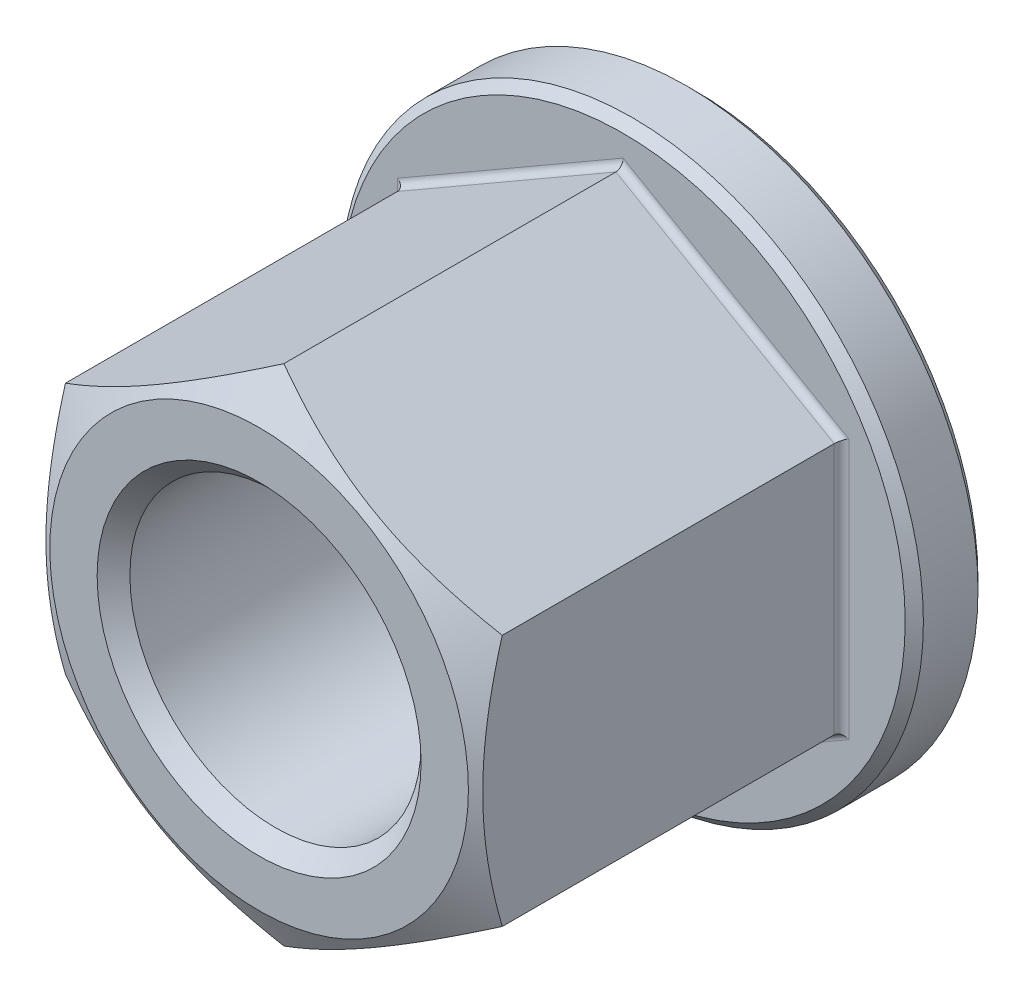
ISO-10303-21;
HEADER;
FILE_DESCRIPTION(('STEP AP214'),'2;1');
FILE_NAME('part.step','',(''),(''),'','','');
FILE_SCHEMA(('AUTOMOTIVE_DESIGN { 1 0 10303 214 1 1 1 1 }'));
ENDSEC;
DATA;
#1=APPLICATION_CONTEXT('core data for automotive mechanical design processes');
#2=APPLICATION_PROTOCOL_DEFINITION('international standard','automotive_design',2000,#1);
#3=PRODUCT_CONTEXT('',#1,'mechanical');
#4=PRODUCT('Part','Part','',(#3));
#5=PRODUCT_RELATED_PRODUCT_CATEGORY('part','',(#4));
#6=PRODUCT_DEFINITION_FORMATION('','',#4);
#7=PRODUCT_DEFINITION_CONTEXT('part definition',#1,'design');
#8=PRODUCT_DEFINITION('design','',#6,#7);
#9=PRODUCT_DEFINITION_SHAPE('','',#8);
#10=(LENGTH_UNIT() NAMED_UNIT(*) SI_UNIT(.MILLI.,.METRE.));
#11=(NAMED_UNIT(*) PLANE_ANGLE_UNIT() SI_UNIT($,.RADIAN.));
#12=(NAMED_UNIT(*) SI_UNIT($,.STERADIAN.) SOLID_ANGLE_UNIT());
#13=UNCERTAINTY_MEASURE_WITH_UNIT(LENGTH_MEASURE(1.E-05),#10,'distance_accuracy_value','');
#14=(GEOMETRIC_REPRESENTATION_CONTEXT(3) GLOBAL_UNCERTAINTY_ASSIGNED_CONTEXT((#13)) GLOBAL_UNIT_ASSIGNED_CONTEXT((#10,
#11,#12)) REPRESENTATION_CONTEXT('',''));
#15=CARTESIAN_POINT('',(0.,0.,0.));
#16=DIRECTION('',(0.,0.,1.));
#17=DIRECTION('',(1.,0.,0.));
#18=AXIS2_PLACEMENT_3D('',#15,#16,#17);
#19=CARTESIAN_POINT('',(-16.,0.,24.));
#20=DIRECTION('',(0.,0.,-1.));
#21=DIRECTION('',(-1.,0.,0.));
#22=AXIS2_PLACEMENT_3D('',#19,#20,#21);
#23=PLANE('',#22);
#24=CARTESIAN_POINT('',(0.,0.,24.));
#25=DIRECTION('',(0.,0.,-1.));
#26=DIRECTION('',(-1.,0.,0.));
#27=AXIS2_PLACEMENT_3D('',#24,#25,#26);
#28=CIRCLE('',#27,8.9);
#29=CARTESIAN_POINT('',(-8.9,0.,24.));
#30=VERTEX_POINT('',#29);
#31=EDGE_CURVE('E247',#30,#30,#28,.T.);
#32=ORIENTED_EDGE('',*,*,#31,.T.);
#33=EDGE_LOOP('',(#32));
#34=FACE_BOUND('',#33,.T.);
#35=CARTESIAN_POINT('',(0.,0.,24.));
#36=DIRECTION('',(0.,0.,1.));
#37=DIRECTION('',(1.,0.,0.));
#38=AXIS2_PLACEMENT_3D('',#35,#36,#37);
#39=CIRCLE('',#38,11.5);
#40=CARTESIAN_POINT('',(11.5,0.,24.));
#41=VERTEX_POINT('',#40);
#42=EDGE_CURVE('E113',#41,#41,#39,.T.);
#43=ORIENTED_EDGE('',*,*,#42,.T.);
#44=EDGE_LOOP('',(#43));
#45=FACE_BOUND('',#44,.T.);
#46=ADVANCED_FACE('F14',(#34,#45),#23,.F.);
#47=CARTESIAN_POINT('',(-12.,-6.92820323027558,4.));
#48=DIRECTION('',(-0.5,-0.86602540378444,0.));
#49=DIRECTION('',(0.86602540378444,-0.5,0.));
#50=AXIS2_PLACEMENT_3D('',#47,#48,#49);
#51=PLANE('',#50);
#52=DIRECTION('',(0.,0.,1.));
#53=VECTOR('',#52,1.);
#54=CARTESIAN_POINT('',(-12.,-6.92820323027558,4.));
#55=LINE('',#54,#53);
#56=CARTESIAN_POINT('',(-12.,-6.92820323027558,4.4));
#57=VERTEX_POINT('',#56);
#58=CARTESIAN_POINT('',(-12.,-6.92820323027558,22.6395280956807));
#59=VERTEX_POINT('',#58);
#60=EDGE_CURVE('E109',#57,#59,#55,.T.);
#61=ORIENTED_EDGE('',*,*,#60,.F.);
#62=DIRECTION('',(0.866025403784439,-0.5,0.));
#63=VECTOR('',#62,1.);
#64=CARTESIAN_POINT('',(0.,-13.8564064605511,4.4));
#65=LINE('',#64,#63);
#66=CARTESIAN_POINT('',(0.,-13.8564064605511,4.4));
#67=VERTEX_POINT('',#66);
#68=EDGE_CURVE('E183',#57,#67,#65,.T.);
#69=ORIENTED_EDGE('',*,*,#68,.T.);
#70=DIRECTION('',(0.,0.,1.));
#71=VECTOR('',#70,1.);
#72=CARTESIAN_POINT('',(0.,-13.8564064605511,4.));
#73=LINE('',#72,#71);
#74=CARTESIAN_POINT('',(0.,-13.8564064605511,22.6395280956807));
#75=VERTEX_POINT('',#74);
#76=EDGE_CURVE('E95',#67,#75,#73,.T.);
#77=ORIENTED_EDGE('',*,*,#76,.T.);
#78=CARTESIAN_POINT('',(0.000199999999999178,-13.8565219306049,22.6394614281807));
#79=CARTESIAN_POINT('',(-0.263585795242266,-13.7042251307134,22.7273752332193));
#80=CARTESIAN_POINT('',(-0.528355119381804,-13.5513604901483,22.8112988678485));
#81=CARTESIAN_POINT('',(-1.06001701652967,-13.2444053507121,22.9700586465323));
#82=CARTESIAN_POINT('',(-1.32691025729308,-13.0903144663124,23.0448918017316));
#83=CARTESIAN_POINT('',(-2.13189040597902,-12.6255589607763,23.254307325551));
#84=CARTESIAN_POINT('',(-2.67315507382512,-12.3130596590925,23.3734216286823));
#85=CARTESIAN_POINT('',(-3.48313282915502,-11.8454187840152,23.513093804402));
#86=CARTESIAN_POINT('',(-3.74942610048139,-11.6916742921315,23.5528810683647));
#87=CARTESIAN_POINT('',(-4.28324559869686,-11.3834734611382,23.6196014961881));
#88=CARTESIAN_POINT('',(-4.5507718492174,-11.2290171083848,23.6465344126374));
#89=CARTESIAN_POINT('',(-5.08627036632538,-10.9198468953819,23.6868562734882));
#90=CARTESIAN_POINT('',(-5.35424172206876,-10.7651335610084,23.7002613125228));
#91=CARTESIAN_POINT('',(-5.89043273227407,-10.4555635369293,23.713241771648));
#92=CARTESIAN_POINT('',(-6.15865237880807,-10.3007068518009,23.7128176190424));
#93=CARTESIAN_POINT('',(-6.66008937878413,-10.0112020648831,23.6991048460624));
#94=CARTESIAN_POINT('',(-6.89334249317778,-9.87653331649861,23.6874888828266));
#95=CARTESIAN_POINT('',(-7.35931224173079,-9.6075055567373,23.6540168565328));
#96=CARTESIAN_POINT('',(-7.59202883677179,-9.47314656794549,23.6321600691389));
#97=CARTESIAN_POINT('',(-8.05679907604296,-9.20481134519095,23.5785874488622));
#98=CARTESIAN_POINT('',(-8.28885201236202,-9.0708355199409,23.5468634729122));
#99=CARTESIAN_POINT('',(-8.751869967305,-8.80351197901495,23.4741130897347));
#100=CARTESIAN_POINT('',(-8.98283491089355,-8.67016430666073,23.433086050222));
#101=CARTESIAN_POINT('',(-9.68394195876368,-8.26537996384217,23.2950132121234));
#102=CARTESIAN_POINT('',(-10.1520537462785,-7.99511549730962,23.1841999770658));
#103=CARTESIAN_POINT('',(-11.0812971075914,-7.45861659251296,22.9326990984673));
#104=CARTESIAN_POINT('',(-11.5424405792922,-7.1923752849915,22.7920705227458));
#105=CARTESIAN_POINT('',(-12.0002,-6.92808776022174,22.6394614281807));
#106=B_SPLINE_CURVE_WITH_KNOTS('',3,(#78,#79,#80,#81,#82,#83,#84,#85,#86,#87,#88,#89,#90,#91,
#92,#93,#94,#95,#96,#97,#98,#99,#100,#101,#102,#103,#104,#105),.UNSPECIFIED.,.F.,.F.,(4,2,2,2,2,
2,2,2,2,2,2,2,2,4),(0.,0.951004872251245,1.90232158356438,3.8090046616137,4.73894551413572,
5.66890426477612,6.59775529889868,7.52657763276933,8.3351464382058,9.1437724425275,
9.95306755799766,10.7624176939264,12.4167102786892,14.0677556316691),.UNSPECIFIED.);
#107=EDGE_CURVE('E107',#75,#59,#106,.T.);
#108=ORIENTED_EDGE('',*,*,#107,.T.);
#109=EDGE_LOOP('',(#61,#69,#77,#108));
#110=FACE_BOUND('',#109,.T.);
#111=ADVANCED_FACE('F168',(#110),#51,.T.);
#112=CARTESIAN_POINT('',(-12.,6.92820323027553,4.));
#113=DIRECTION('',(-1.,0.,0.));
#114=DIRECTION('',(0.,-1.,0.));
#115=AXIS2_PLACEMENT_3D('',#112,#113,#114);
#116=PLANE('',#115);
#117=DIRECTION('',(0.,0.,1.));
#118=VECTOR('',#117,1.);
#119=CARTESIAN_POINT('',(-12.,6.92820323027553,4.));
#120=LINE('',#119,#118);
#121=CARTESIAN_POINT('',(-12.,6.92820323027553,4.4));
#122=VERTEX_POINT('',#121);
#123=CARTESIAN_POINT('',(-12.,6.92820323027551,22.6395280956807));
#124=VERTEX_POINT('',#123);
#125=EDGE_CURVE('E184',#122,#124,#120,.T.);
#126=ORIENTED_EDGE('',*,*,#125,.F.);
#127=DIRECTION('',(0.,-1.,0.));
#128=VECTOR('',#127,1.);
#129=CARTESIAN_POINT('',(-12.,-6.92820323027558,4.4));
#130=LINE('',#129,#128);
#131=EDGE_CURVE('E193',#122,#57,#130,.T.);
#132=ORIENTED_EDGE('',*,*,#131,.T.);
#133=ORIENTED_EDGE('',*,*,#60,.T.);
#134=CARTESIAN_POINT('',(-12.,-18.5173220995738,17.8999412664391));
#135=CARTESIAN_POINT('',(-12.,-18.2556548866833,18.026718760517));
#136=CARTESIAN_POINT('',(-12.,-17.9936780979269,18.1528569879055));
#137=CARTESIAN_POINT('',(-12.,-17.4690407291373,18.4037099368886));
#138=CARTESIAN_POINT('',(-12.,-17.2063801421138,18.52842464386));
#139=CARTESIAN_POINT('',(-12.,-16.4172044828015,18.900249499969));
#140=CARTESIAN_POINT('',(-12.,-15.8895743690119,19.1450020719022));
#141=CARTESIAN_POINT('',(-12.,-14.8278359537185,19.6280601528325));
#142=CARTESIAN_POINT('',(-12.,-14.2937079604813,19.86632248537));
#143=CARTESIAN_POINT('',(-12.,-13.2211715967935,20.3329756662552));
#144=CARTESIAN_POINT('',(-12.,-12.6827634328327,20.561366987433));
#145=CARTESIAN_POINT('',(-12.,-11.5838024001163,21.0126469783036));
#146=CARTESIAN_POINT('',(-12.,-11.0230851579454,21.2351374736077));
#147=CARTESIAN_POINT('',(-12.,-9.89505250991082,21.6630547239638));
#148=CARTESIAN_POINT('',(-12.,-9.32773636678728,21.8684795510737));
#149=CARTESIAN_POINT('',(-12.,-8.18671425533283,22.2568017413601));
#150=CARTESIAN_POINT('',(-12.,-7.61302421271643,22.4397455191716));
#151=CARTESIAN_POINT('',(-12.,-6.45736105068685,22.7771839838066));
#152=CARTESIAN_POINT('',(-12.,-5.87539063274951,22.931687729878));
#153=CARTESIAN_POINT('',(-12.,-4.99773238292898,23.1360569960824));
#154=CARTESIAN_POINT('',(-12.,-4.70518231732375,23.1994826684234));
#155=CARTESIAN_POINT('',(-12.,-4.1181008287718,23.3164400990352));
#156=CARTESIAN_POINT('',(-12.,-3.82356944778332,23.3699720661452));
#157=CARTESIAN_POINT('',(-12.,-3.23273474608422,23.4661916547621));
#158=CARTESIAN_POINT('',(-12.,-2.93643144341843,23.5088793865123));
#159=CARTESIAN_POINT('',(-12.,-2.34237499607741,23.5825554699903));
#160=CARTESIAN_POINT('',(-12.,-2.04462190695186,23.613544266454));
#161=CARTESIAN_POINT('',(-12.,-1.45192885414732,23.6628234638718));
#162=CARTESIAN_POINT('',(-12.,-1.15700216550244,23.6812725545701));
#163=CARTESIAN_POINT('',(-12.,-0.566633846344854,23.7056885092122));
#164=CARTESIAN_POINT('',(-12.,-0.271192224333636,23.7116555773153));
#165=CARTESIAN_POINT('',(-12.,0.319680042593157,23.7109658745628));
#166=CARTESIAN_POINT('',(-12.,0.615110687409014,23.7043090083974));
#167=CARTESIAN_POINT('',(-12.,1.20543136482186,23.6785321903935));
#168=CARTESIAN_POINT('',(-12.,1.50032137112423,23.6594116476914));
#169=CARTESIAN_POINT('',(-12.,2.21185884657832,23.5986407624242));
#170=CARTESIAN_POINT('',(-12.,2.6279967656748,23.5509201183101));
#171=CARTESIAN_POINT('',(-12.,3.4571252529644,23.4332802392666));
#172=CARTESIAN_POINT('',(-12.,3.87011537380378,23.3633579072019));
#173=CARTESIAN_POINT('',(-12.,4.69257458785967,23.2038022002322));
#174=CARTESIAN_POINT('',(-12.,5.10204061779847,23.1141531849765));
#175=CARTESIAN_POINT('',(-12.,5.91683664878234,22.9178742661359));
#176=CARTESIAN_POINT('',(-12.,6.32216671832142,22.8112446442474));
#177=CARTESIAN_POINT('',(-12.,7.1375608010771,22.5810853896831));
#178=CARTESIAN_POINT('',(-12.,7.54753418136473,22.4572368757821));
#179=CARTESIAN_POINT('',(-12.,8.36344122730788,22.196947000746));
#180=CARTESIAN_POINT('',(-12.,8.76937486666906,22.0605055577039));
#181=CARTESIAN_POINT('',(-12.,9.5774067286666,21.7771784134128));
#182=CARTESIAN_POINT('',(-12.,9.97950622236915,21.6302963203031));
#183=CARTESIAN_POINT('',(-12.,10.7803867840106,21.3277959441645));
#184=CARTESIAN_POINT('',(-12.,11.1791678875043,21.1721777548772));
#185=CARTESIAN_POINT('',(-12.,12.1066298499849,20.8004102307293));
#186=CARTESIAN_POINT('',(-12.,12.6341689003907,20.5814169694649));
#187=CARTESIAN_POINT('',(-12.,13.6848815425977,20.1331681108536));
#188=CARTESIAN_POINT('',(-12.,14.208054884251,19.9039119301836));
#189=CARTESIAN_POINT('',(-12.,15.2508319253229,19.4371558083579));
#190=CARTESIAN_POINT('',(-12.,15.7704348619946,19.199654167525));
#191=CARTESIAN_POINT('',(-12.,16.8065478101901,18.7180393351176));
#192=CARTESIAN_POINT('',(-12.,17.3230578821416,18.4739262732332));
#193=CARTESIAN_POINT('',(-12.,18.3540223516,17.9800481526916));
#194=CARTESIAN_POINT('',(-12.,18.868474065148,17.7302775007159));
#195=CARTESIAN_POINT('',(-12.,19.89519003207,17.2262809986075));
#196=CARTESIAN_POINT('',(-12.,20.4074542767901,16.9720551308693));
#197=CARTESIAN_POINT('',(-12.,21.4300648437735,16.4599305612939));
#198=CARTESIAN_POINT('',(-12.,21.9404113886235,16.2020323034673));
#199=CARTESIAN_POINT('',(-12.,22.9595211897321,15.6831246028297));
#200=CARTESIAN_POINT('',(-12.,23.4682844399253,15.4221151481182));
#201=CARTESIAN_POINT('',(-12.,24.909614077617,14.6779720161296));
#202=CARTESIAN_POINT('',(-12.,25.8405746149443,14.1917279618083));
#203=CARTESIAN_POINT('',(-12.,27.6990334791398,13.2126098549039));
#204=CARTESIAN_POINT('',(-12.,28.6265316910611,12.7197355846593));
#205=CARTESIAN_POINT('',(-12.,30.4766080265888,11.7300698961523));
#206=CARTESIAN_POINT('',(-12.,31.3991926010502,11.2332905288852));
#207=CARTESIAN_POINT('',(-12.,32.7814296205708,10.4851527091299));
#208=CARTESIAN_POINT('',(-12.,33.2418901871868,10.2352850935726));
#209=CARTESIAN_POINT('',(-12.,34.1623256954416,9.7346586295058));
#210=CARTESIAN_POINT('',(-12.,34.6223006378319,9.48389978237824));
#211=CARTESIAN_POINT('',(-12.,35.082060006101,9.2327461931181));
#212=B_SPLINE_CURVE_WITH_KNOTS('',3,(#134,#135,#136,#137,#138,#139,#140,#141,#142,#143,#144,
#145,#146,#147,#148,#149,#150,#151,#152,#153,#154,#155,#156,#157,#158,#159,#160,#161,#162,#163,
#164,#165,#166,#167,#168,#169,#170,#171,#172,#173,#174,#175,#176,#177,#178,#179,#180,#181,#182,
#183,#184,#185,#186,#187,#188,#189,#190,#191,#192,#193,#194,#195,#196,#197,#198,#199,#200,#201,
#202,#203,#204,#205,#206,#207,#208,#209,#210,#211),.UNSPECIFIED.,.F.,.F.,(4,2,2,2,2,2,2,2,2,2,2,
2,2,2,2,2,2,2,2,2,2,2,2,2,2,2,2,2,2,2,2,2,2,2,2,2,2,2,4),(0.,0.872282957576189,1.74457486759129,
3.48942168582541,5.24392502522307,6.99834422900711,8.80787044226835,10.6176008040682,
12.4235296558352,14.2288822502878,15.1267816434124,16.0246620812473,16.9225333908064,
17.8203705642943,18.7066228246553,19.5928605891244,20.4791050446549,21.3653915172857,
22.6212900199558,23.8773637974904,25.1344370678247,26.3914894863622,27.6760622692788,
28.9606434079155,30.2447827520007,31.5289083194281,33.2423257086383,34.955840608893,
36.6697108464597,38.3835474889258,40.0991596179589,41.8147785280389,43.5301917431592,
45.2456115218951,48.3964579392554,51.5474080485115,54.6908909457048,56.262551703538,
57.8342100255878),.UNSPECIFIED.);
#213=EDGE_CURVE('E156',#59,#124,#212,.T.);
#214=ORIENTED_EDGE('',*,*,#213,.T.);
#215=EDGE_LOOP('',(#126,#132,#133,#214));
#216=FACE_BOUND('',#215,.T.);
#217=ADVANCED_FACE('F146',(#216),#116,.T.);
#218=CARTESIAN_POINT('',(0.,13.856406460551,4.));
#219=DIRECTION('',(-0.5,0.86602540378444,0.));
#220=DIRECTION('',(-0.86602540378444,-0.5,0.));
#221=AXIS2_PLACEMENT_3D('',#218,#219,#220);
#222=PLANE('',#221);
#223=DIRECTION('',(0.,0.,1.));
#224=VECTOR('',#223,1.);
#225=CARTESIAN_POINT('',(0.,13.856406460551,4.));
#226=LINE('',#225,#224);
#227=CARTESIAN_POINT('',(0.,13.856406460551,4.4));
#228=VERTEX_POINT('',#227);
#229=CARTESIAN_POINT('',(0.,13.856406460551,22.6395280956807));
#230=VERTEX_POINT('',#229);
#231=EDGE_CURVE('E294',#228,#230,#226,.T.);
#232=ORIENTED_EDGE('',*,*,#231,.F.);
#233=DIRECTION('',(-0.866025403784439,-0.5,0.));
#234=VECTOR('',#233,1.);
#235=CARTESIAN_POINT('',(-12.,6.92820323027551,4.4));
#236=LINE('',#235,#234);
#237=EDGE_CURVE('E205',#228,#122,#236,.T.);
#238=ORIENTED_EDGE('',*,*,#237,.T.);
#239=ORIENTED_EDGE('',*,*,#125,.T.);
#240=CARTESIAN_POINT('',(-12.0002,6.92808776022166,22.6394614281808));
#241=CARTESIAN_POINT('',(-11.7364142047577,7.08038456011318,22.7273752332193));
#242=CARTESIAN_POINT('',(-11.4716448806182,7.2332492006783,22.8112988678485));
#243=CARTESIAN_POINT('',(-10.9399829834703,7.54020434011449,22.9700586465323));
#244=CARTESIAN_POINT('',(-10.6730897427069,7.69429522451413,23.0448918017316));
#245=CARTESIAN_POINT('',(-9.86810959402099,8.15905073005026,23.254307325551));
#246=CARTESIAN_POINT('',(-9.3268449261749,8.47155003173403,23.3734216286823));
#247=CARTESIAN_POINT('',(-8.51686717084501,8.93919090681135,23.513093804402));
#248=CARTESIAN_POINT('',(-8.25057389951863,9.09293539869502,23.5528810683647));
#249=CARTESIAN_POINT('',(-7.71675440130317,9.40113622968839,23.6196014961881));
#250=CARTESIAN_POINT('',(-7.44922815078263,9.55559258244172,23.6465344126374));
#251=CARTESIAN_POINT('',(-6.91372963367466,9.86476279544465,23.6868562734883));
#252=CARTESIAN_POINT('',(-6.64575827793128,10.0194761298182,23.7002613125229));
#253=CARTESIAN_POINT('',(-6.10956726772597,10.3290461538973,23.713241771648));
#254=CARTESIAN_POINT('',(-5.84134762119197,10.4839028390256,23.7128176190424));
#255=CARTESIAN_POINT('',(-5.3399106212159,10.7734076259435,23.6991048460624));
#256=CARTESIAN_POINT('',(-5.10665750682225,10.908076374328,23.6874888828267));
#257=CARTESIAN_POINT('',(-4.64068775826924,11.1771041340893,23.6540168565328));
#258=CARTESIAN_POINT('',(-4.40797116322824,11.3114631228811,23.632160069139));
#259=CARTESIAN_POINT('',(-3.94320092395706,11.5797983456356,23.5785874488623));
#260=CARTESIAN_POINT('',(-3.711147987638,11.7137741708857,23.5468634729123));
#261=CARTESIAN_POINT('',(-3.24813003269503,11.9810977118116,23.4741130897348));
#262=CARTESIAN_POINT('',(-3.01716508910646,12.1144453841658,23.433086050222));
#263=CARTESIAN_POINT('',(-2.31605804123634,12.5192297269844,23.2950132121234));
#264=CARTESIAN_POINT('',(-1.84794625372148,12.7894941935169,23.1841999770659));
#265=CARTESIAN_POINT('',(-0.918702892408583,13.3259930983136,22.9326990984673));
#266=CARTESIAN_POINT('',(-0.45755942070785,13.5922344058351,22.7920705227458));
#267=CARTESIAN_POINT('',(0.000199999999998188,13.8565219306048,22.6394614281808));
#268=B_SPLINE_CURVE_WITH_KNOTS('',3,(#240,#241,#242,#243,#244,#245,#246,#247,#248,#249,#250,
#251,#252,#253,#254,#255,#256,#257,#258,#259,#260,#261,#262,#263,#264,#265,#266,#267),
.UNSPECIFIED.,.F.,.F.,(4,2,2,2,2,2,2,2,2,2,2,2,2,4),(0.,0.95100487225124,1.90232158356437,
3.80900466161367,4.73894551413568,5.66890426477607,6.59775529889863,7.52657763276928,
8.33514643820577,9.14377244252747,9.95306755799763,10.7624176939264,12.4167102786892,
14.0677556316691),.UNSPECIFIED.);
#269=EDGE_CURVE('E115',#124,#230,#268,.T.);
#270=ORIENTED_EDGE('',*,*,#269,.T.);
#271=EDGE_LOOP('',(#232,#238,#239,#270));
#272=FACE_BOUND('',#271,.T.);
#273=ADVANCED_FACE('F142',(#272),#222,.T.);
#274=CARTESIAN_POINT('',(12.,6.92820323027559,4.));
#275=DIRECTION('',(0.499999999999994,0.866025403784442,0.));
#276=DIRECTION('',(-0.866025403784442,0.499999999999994,0.));
#277=AXIS2_PLACEMENT_3D('',#274,#275,#276);
#278=PLANE('',#277);
#279=DIRECTION('',(0.,0.,1.));
#280=VECTOR('',#279,1.);
#281=CARTESIAN_POINT('',(12.,6.92820323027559,4.));
#282=LINE('',#281,#280);
#283=CARTESIAN_POINT('',(12.,6.92820323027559,4.4));
#284=VERTEX_POINT('',#283);
#285=CARTESIAN_POINT('',(12.,6.92820323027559,22.6395280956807));
#286=VERTEX_POINT('',#285);
#287=EDGE_CURVE('E94',#284,#286,#282,.T.);
#288=ORIENTED_EDGE('',*,*,#287,.F.);
#289=DIRECTION('',(-0.866025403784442,0.499999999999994,0.));
#290=VECTOR('',#289,1.);
#291=CARTESIAN_POINT('',(0.,13.856406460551,4.4));
#292=LINE('',#291,#290);
#293=EDGE_CURVE('E36',#284,#228,#292,.T.);
#294=ORIENTED_EDGE('',*,*,#293,.T.);
#295=ORIENTED_EDGE('',*,*,#231,.T.);
#296=CARTESIAN_POINT('',(-0.000200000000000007,13.8565219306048,22.6394614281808));
#297=CARTESIAN_POINT('',(0.263585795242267,13.7042251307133,22.7273752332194));
#298=CARTESIAN_POINT('',(0.528355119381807,13.5513604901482,22.8112988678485));
#299=CARTESIAN_POINT('',(1.06001701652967,13.244405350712,22.9700586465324));
#300=CARTESIAN_POINT('',(1.32691025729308,13.0903144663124,23.0448918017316));
#301=CARTESIAN_POINT('',(2.13189040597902,12.6255589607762,23.254307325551));
#302=CARTESIAN_POINT('',(2.67315507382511,12.3130596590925,23.3734216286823));
#303=CARTESIAN_POINT('',(3.48313282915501,11.8454187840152,23.513093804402));
#304=CARTESIAN_POINT('',(3.74942610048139,11.6916742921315,23.5528810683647));
#305=CARTESIAN_POINT('',(4.28324559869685,11.3834734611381,23.6196014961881));
#306=CARTESIAN_POINT('',(4.55077184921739,11.2290171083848,23.6465344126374));
#307=CARTESIAN_POINT('',(5.08627036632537,10.9198468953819,23.6868562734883));
#308=CARTESIAN_POINT('',(5.35424172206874,10.7651335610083,23.7002613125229));
#309=CARTESIAN_POINT('',(5.89043273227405,10.4555635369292,23.713241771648));
#310=CARTESIAN_POINT('',(6.15865237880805,10.3007068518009,23.7128176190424));
#311=CARTESIAN_POINT('',(6.66008937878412,10.0112020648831,23.6991048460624));
#312=CARTESIAN_POINT('',(6.89334249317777,9.87653331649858,23.6874888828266));
#313=CARTESIAN_POINT('',(7.35931224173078,9.60750555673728,23.6540168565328));
#314=CARTESIAN_POINT('',(7.59202883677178,9.47314656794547,23.6321600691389));
#315=CARTESIAN_POINT('',(8.05679907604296,9.20481134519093,23.5785874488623));
#316=CARTESIAN_POINT('',(8.28885201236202,9.07083551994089,23.5468634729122));
#317=CARTESIAN_POINT('',(8.75186996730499,8.80351197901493,23.4741130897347));
#318=CARTESIAN_POINT('',(8.98283491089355,8.67016430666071,23.433086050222));
#319=CARTESIAN_POINT('',(9.68394195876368,8.26537996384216,23.2950132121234));
#320=CARTESIAN_POINT('',(10.1520537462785,7.99511549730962,23.1841999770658));
#321=CARTESIAN_POINT('',(11.0812971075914,7.45861659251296,22.9326990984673));
#322=CARTESIAN_POINT('',(11.5424405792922,7.19237528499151,22.7920705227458));
#323=CARTESIAN_POINT('',(12.0002,6.92808776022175,22.6394614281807));
#324=B_SPLINE_CURVE_WITH_KNOTS('',3,(#296,#297,#298,#299,#300,#301,#302,#303,#304,#305,#306,
#307,#308,#309,#310,#311,#312,#313,#314,#315,#316,#317,#318,#319,#320,#321,#322,#323),
.UNSPECIFIED.,.F.,.F.,(4,2,2,2,2,2,2,2,2,2,2,2,2,4),(0.,0.951004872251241,1.90232158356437,
3.80900466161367,4.73894551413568,5.66890426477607,6.59775529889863,7.52657763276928,
8.33514643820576,9.14377244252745,9.95306755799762,10.7624176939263,12.4167102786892,
14.0677556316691),.UNSPECIFIED.);
#325=EDGE_CURVE('E112',#230,#286,#324,.T.);
#326=ORIENTED_EDGE('',*,*,#325,.T.);
#327=EDGE_LOOP('',(#288,#294,#295,#326));
#328=FACE_BOUND('',#327,.T.);
#329=ADVANCED_FACE('F137',(#328),#278,.T.);
#330=CARTESIAN_POINT('',(12.,-6.92820323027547,4.));
#331=DIRECTION('',(1.,0.,0.));
#332=DIRECTION('',(0.,1.,0.));
#333=AXIS2_PLACEMENT_3D('',#330,#331,#332);
#334=PLANE('',#333);
#335=DIRECTION('',(0.,0.,1.));
#336=VECTOR('',#335,1.);
#337=CARTESIAN_POINT('',(12.,-6.92820323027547,4.));
#338=LINE('',#337,#336);
#339=CARTESIAN_POINT('',(12.,-6.92820323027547,4.4));
#340=VERTEX_POINT('',#339);
#341=CARTESIAN_POINT('',(12.,-6.92820323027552,22.6395280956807));
#342=VERTEX_POINT('',#341);
#343=EDGE_CURVE('E86',#340,#342,#338,.T.);
#344=ORIENTED_EDGE('',*,*,#343,.F.);
#345=DIRECTION('',(0.,1.,0.));
#346=VECTOR('',#345,1.);
#347=CARTESIAN_POINT('',(12.,6.92820323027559,4.4));
#348=LINE('',#347,#346);
#349=EDGE_CURVE('E29',#340,#284,#348,.T.);
#350=ORIENTED_EDGE('',*,*,#349,.T.);
#351=ORIENTED_EDGE('',*,*,#287,.T.);
#352=CARTESIAN_POINT('',(12.,-18.51732209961,17.8999412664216));
#353=CARTESIAN_POINT('',(12.,-18.2556548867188,18.0267187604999));
#354=CARTESIAN_POINT('',(12.,-17.9936780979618,18.1528569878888));
#355=CARTESIAN_POINT('',(12.,-17.469040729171,18.4037099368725));
#356=CARTESIAN_POINT('',(12.,-17.2063801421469,18.5284246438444));
#357=CARTESIAN_POINT('',(12.,-16.4172044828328,18.9002494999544));
#358=CARTESIAN_POINT('',(12.,-15.889574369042,19.1450020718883));
#359=CARTESIAN_POINT('',(12.,-14.8278359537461,19.6280601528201));
#360=CARTESIAN_POINT('',(12.,-14.2937079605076,19.8663224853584));
#361=CARTESIAN_POINT('',(12.,-13.2211715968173,20.332975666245));
#362=CARTESIAN_POINT('',(12.,-12.6827634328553,20.5613669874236));
#363=CARTESIAN_POINT('',(12.,-11.5838024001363,21.0126469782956));
#364=CARTESIAN_POINT('',(12.,-11.023085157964,21.2351374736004));
#365=CARTESIAN_POINT('',(12.,-9.89505250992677,21.6630547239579));
#366=CARTESIAN_POINT('',(12.,-9.32773636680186,21.8684795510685));
#367=CARTESIAN_POINT('',(12.,-8.18671425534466,22.2568017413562));
#368=CARTESIAN_POINT('',(12.,-7.61302421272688,22.4397455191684));
#369=CARTESIAN_POINT('',(12.,-6.45736105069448,22.7771839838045));
#370=CARTESIAN_POINT('',(12.,-5.87539063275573,22.9316877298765));
#371=CARTESIAN_POINT('',(12.,-4.99773238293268,23.1360569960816));
#372=CARTESIAN_POINT('',(12.,-4.70518231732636,23.1994826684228));
#373=CARTESIAN_POINT('',(12.,-4.11810082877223,23.3164400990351));
#374=CARTESIAN_POINT('',(12.,-3.82356944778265,23.3699720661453));
#375=CARTESIAN_POINT('',(12.,-3.23273474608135,23.4661916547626));
#376=CARTESIAN_POINT('',(12.,-2.93643144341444,23.5088793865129));
#377=CARTESIAN_POINT('',(12.,-2.34237499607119,23.582555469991));
#378=CARTESIAN_POINT('',(12.,-2.04462190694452,23.6135442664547));
#379=CARTESIAN_POINT('',(12.,-1.45192885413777,23.6628234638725));
#380=CARTESIAN_POINT('',(12.,-1.1570021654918,23.6812725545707));
#381=CARTESIAN_POINT('',(12.,-0.56663384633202,23.7056885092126));
#382=CARTESIAN_POINT('',(12.,-0.271192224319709,23.7116555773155));
#383=CARTESIAN_POINT('',(12.,0.319680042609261,23.7109658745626));
#384=CARTESIAN_POINT('',(12.,0.615110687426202,23.704309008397));
#385=CARTESIAN_POINT('',(12.,1.20543136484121,23.6785321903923));
#386=CARTESIAN_POINT('',(12.,1.50032137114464,23.6594116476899));
#387=CARTESIAN_POINT('',(12.,2.21185884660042,23.5986407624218));
#388=CARTESIAN_POINT('',(12.,2.62799676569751,23.5509201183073));
#389=CARTESIAN_POINT('',(12.,3.45712525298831,23.4332802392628));
#390=CARTESIAN_POINT('',(12.,3.87011537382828,23.3633579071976));
#391=CARTESIAN_POINT('',(12.,4.69257458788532,23.2038022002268));
#392=CARTESIAN_POINT('',(12.,5.10204061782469,23.1141531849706));
#393=CARTESIAN_POINT('',(12.,5.91683664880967,22.9178742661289));
#394=CARTESIAN_POINT('',(12.,6.3221667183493,22.8112446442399));
#395=CARTESIAN_POINT('',(12.,7.1375608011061,22.5810853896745));
#396=CARTESIAN_POINT('',(12.,7.54753418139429,22.457236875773));
#397=CARTESIAN_POINT('',(12.,8.36344122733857,22.1969470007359));
#398=CARTESIAN_POINT('',(12.,8.76937486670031,22.0605055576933));
#399=CARTESIAN_POINT('',(12.,9.57740672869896,21.7771784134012));
#400=CARTESIAN_POINT('',(12.,9.97950622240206,21.6302963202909));
#401=CARTESIAN_POINT('',(12.,10.7803867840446,21.3277959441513));
#402=CARTESIAN_POINT('',(12.,11.1791678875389,21.1721777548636));
#403=CARTESIAN_POINT('',(12.,12.1066298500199,20.800410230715));
#404=CARTESIAN_POINT('',(12.,12.6341689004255,20.5814169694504));
#405=CARTESIAN_POINT('',(12.,13.6848815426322,20.1331681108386));
#406=CARTESIAN_POINT('',(12.,14.2080548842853,19.9039119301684));
#407=CARTESIAN_POINT('',(12.,15.250831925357,19.4371558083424));
#408=CARTESIAN_POINT('',(12.,15.7704348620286,19.1996541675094));
#409=CARTESIAN_POINT('',(12.,16.8065478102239,18.7180393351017));
#410=CARTESIAN_POINT('',(12.,17.3230578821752,18.4739262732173));
#411=CARTESIAN_POINT('',(12.,18.3540223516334,17.9800481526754));
#412=CARTESIAN_POINT('',(12.,18.8684740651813,17.7302775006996));
#413=CARTESIAN_POINT('',(12.,19.8951900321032,17.2262809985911));
#414=CARTESIAN_POINT('',(12.,20.4074542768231,16.9720551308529));
#415=CARTESIAN_POINT('',(12.,21.4300648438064,16.4599305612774));
#416=CARTESIAN_POINT('',(12.,21.9404113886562,16.2020323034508));
#417=CARTESIAN_POINT('',(12.,22.9595211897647,15.683124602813));
#418=CARTESIAN_POINT('',(12.,23.4682844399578,15.4221151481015));
#419=CARTESIAN_POINT('',(12.,24.9096140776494,14.6779720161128));
#420=CARTESIAN_POINT('',(12.,25.8405746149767,14.1917279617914));
#421=CARTESIAN_POINT('',(12.,27.6990334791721,13.2126098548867));
#422=CARTESIAN_POINT('',(12.,28.6265316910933,12.7197355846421));
#423=CARTESIAN_POINT('',(12.,30.4766080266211,11.730069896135));
#424=CARTESIAN_POINT('',(12.,31.3991926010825,11.2332905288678));
#425=CARTESIAN_POINT('',(12.,32.7814296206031,10.4851527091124));
#426=CARTESIAN_POINT('',(12.,33.2418901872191,10.235285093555));
#427=CARTESIAN_POINT('',(12.,34.1623256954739,9.73465862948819));
#428=CARTESIAN_POINT('',(12.,34.6223006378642,9.4838997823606));
#429=CARTESIAN_POINT('',(12.,35.0820600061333,9.23274619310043));
#430=B_SPLINE_CURVE_WITH_KNOTS('',3,(#352,#353,#354,#355,#356,#357,#358,#359,#360,#361,#362,
#363,#364,#365,#366,#367,#368,#369,#370,#371,#372,#373,#374,#375,#376,#377,#378,#379,#380,#381,
#382,#383,#384,#385,#386,#387,#388,#389,#390,#391,#392,#393,#394,#395,#396,#397,#398,#399,#400,
#401,#402,#403,#404,#405,#406,#407,#408,#409,#410,#411,#412,#413,#414,#415,#416,#417,#418,#419,
#420,#421,#422,#423,#424,#425,#426,#427,#428,#429),.UNSPECIFIED.,.F.,.F.,(4,2,2,2,2,2,2,2,2,2,2,
2,2,2,2,2,2,2,2,2,2,2,2,2,2,2,2,2,2,2,2,2,2,2,2,2,2,2,4),(0.,0.872282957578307,1.74457486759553,
3.4894216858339,5.24392502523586,6.99834422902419,8.80787044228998,10.6176008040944,
12.4235296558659,14.2288822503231,15.126781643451,16.0246620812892,16.9225333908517,
17.8203705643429,18.7066228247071,19.5928605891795,20.4791050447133,21.3653915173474,
22.6212900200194,23.8773637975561,25.1344370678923,26.3914894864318,27.6760622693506,
28.9606434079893,30.2447827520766,31.5289083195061,33.2423257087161,34.9558406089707,
36.6697108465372,38.3835474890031,40.0991596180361,41.8147785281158,43.5301917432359,
45.2456115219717,48.396457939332,51.5474080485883,54.6908909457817,56.2625517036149,
57.8342100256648),.UNSPECIFIED.);
#431=EDGE_CURVE('E103',#286,#342,#430,.F.);
#432=ORIENTED_EDGE('',*,*,#431,.T.);
#433=EDGE_LOOP('',(#344,#350,#351,#432));
#434=FACE_BOUND('',#433,.T.);
#435=ADVANCED_FACE('F111',(#434),#334,.T.);
#436=CARTESIAN_POINT('',(0.,-13.8564064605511,4.));
#437=DIRECTION('',(0.5,-0.866025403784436,0.));
#438=DIRECTION('',(0.866025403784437,0.5,0.));
#439=AXIS2_PLACEMENT_3D('',#436,#437,#438);
#440=PLANE('',#439);
#441=ORIENTED_EDGE('',*,*,#76,.F.);
#442=DIRECTION('',(0.866025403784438,0.5,0.));
#443=VECTOR('',#442,1.);
#444=CARTESIAN_POINT('',(12.,-6.92820323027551,4.4));
#445=LINE('',#444,#443);
#446=EDGE_CURVE('E92',#67,#340,#445,.T.);
#447=ORIENTED_EDGE('',*,*,#446,.T.);
#448=ORIENTED_EDGE('',*,*,#343,.T.);
#449=CARTESIAN_POINT('',(12.0002,-6.92808776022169,22.6394614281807));
#450=CARTESIAN_POINT('',(11.7364142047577,-7.08038456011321,22.7273752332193));
#451=CARTESIAN_POINT('',(11.4716448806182,-7.23324920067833,22.8112988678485));
#452=CARTESIAN_POINT('',(10.9399829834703,-7.54020434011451,22.9700586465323));
#453=CARTESIAN_POINT('',(10.6730897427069,-7.69429522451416,23.0448918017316));
#454=CARTESIAN_POINT('',(9.86810959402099,-8.15905073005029,23.254307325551));
#455=CARTESIAN_POINT('',(9.3268449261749,-8.47155003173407,23.3734216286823));
#456=CARTESIAN_POINT('',(8.51686717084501,-8.93919090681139,23.513093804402));
#457=CARTESIAN_POINT('',(8.25057389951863,-9.09293539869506,23.5528810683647));
#458=CARTESIAN_POINT('',(7.71675440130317,-9.40113622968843,23.6196014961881));
#459=CARTESIAN_POINT('',(7.44922815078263,-9.55559258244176,23.6465344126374));
#460=CARTESIAN_POINT('',(6.91372963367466,-9.86476279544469,23.6868562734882));
#461=CARTESIAN_POINT('',(6.64575827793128,-10.0194761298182,23.7002613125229));
#462=CARTESIAN_POINT('',(6.10956726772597,-10.3290461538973,23.713241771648));
#463=CARTESIAN_POINT('',(5.84134762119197,-10.4839028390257,23.7128176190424));
#464=CARTESIAN_POINT('',(5.3399106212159,-10.7734076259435,23.6991048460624));
#465=CARTESIAN_POINT('',(5.10665750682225,-10.908076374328,23.6874888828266));
#466=CARTESIAN_POINT('',(4.64068775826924,-11.1771041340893,23.6540168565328));
#467=CARTESIAN_POINT('',(4.40797116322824,-11.3114631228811,23.632160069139));
#468=CARTESIAN_POINT('',(3.94320092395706,-11.5797983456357,23.5785874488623));
#469=CARTESIAN_POINT('',(3.71114798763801,-11.7137741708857,23.5468634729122));
#470=CARTESIAN_POINT('',(3.24813003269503,-11.9810977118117,23.4741130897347));
#471=CARTESIAN_POINT('',(3.01716508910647,-12.1144453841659,23.433086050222));
#472=CARTESIAN_POINT('',(2.31605804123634,-12.5192297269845,23.2950132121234));
#473=CARTESIAN_POINT('',(1.84794625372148,-12.789494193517,23.1841999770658));
#474=CARTESIAN_POINT('',(0.918702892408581,-13.3259930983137,22.9326990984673));
#475=CARTESIAN_POINT('',(0.457559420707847,-13.5922344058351,22.7920705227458));
#476=CARTESIAN_POINT('',(-0.000199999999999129,-13.8565219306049,22.6394614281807));
#477=B_SPLINE_CURVE_WITH_KNOTS('',3,(#449,#450,#451,#452,#453,#454,#455,#456,#457,#458,#459,
#460,#461,#462,#463,#464,#465,#466,#467,#468,#469,#470,#471,#472,#473,#474,#475,#476),
.UNSPECIFIED.,.F.,.F.,(4,2,2,2,2,2,2,2,2,2,2,2,2,4),(0.,0.951004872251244,1.90232158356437,
3.80900466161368,4.7389455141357,5.66890426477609,6.59775529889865,7.5265776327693,
8.33514643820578,9.14377244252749,9.95306755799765,10.7624176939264,12.4167102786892,
14.0677556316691),.UNSPECIFIED.);
#478=EDGE_CURVE('E90',#342,#75,#477,.T.);
#479=ORIENTED_EDGE('',*,*,#478,.T.);
#480=EDGE_LOOP('',(#441,#447,#448,#479));
#481=FACE_BOUND('',#480,.T.);
#482=ADVANCED_FACE('F89',(#481),#440,.T.);
#483=CARTESIAN_POINT('',(0.,0.,20.));
#484=DIRECTION('',(0.,0.,1.));
#485=DIRECTION('',(1.,0.,0.));
#486=AXIS2_PLACEMENT_3D('',#483,#484,#485);
#487=CYLINDRICAL_SURFACE('',#486,16.);
#488=CARTESIAN_POINT('',(0.,0.,0.499999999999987));
#489=DIRECTION('',(0.,0.,1.));
#490=DIRECTION('',(1.,0.,0.));
#491=AXIS2_PLACEMENT_3D('',#488,#489,#490);
#492=CIRCLE('',#491,16.);
#493=CARTESIAN_POINT('',(16.,0.,0.499999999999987));
#494=VERTEX_POINT('',#493);
#495=EDGE_CURVE('E259',#494,#494,#492,.T.);
#496=ORIENTED_EDGE('',*,*,#495,.T.);
#497=EDGE_LOOP('',(#496));
#498=FACE_BOUND('',#497,.T.);
#499=CARTESIAN_POINT('',(0.,0.,3.5));
#500=DIRECTION('',(0.,0.,1.));
#501=DIRECTION('',(1.,0.,0.));
#502=AXIS2_PLACEMENT_3D('',#499,#500,#501);
#503=CIRCLE('',#502,16.);
#504=CARTESIAN_POINT('',(16.,0.,3.5));
#505=VERTEX_POINT('',#504);
#506=EDGE_CURVE('E250',#505,#505,#503,.F.);
#507=ORIENTED_EDGE('',*,*,#506,.T.);
#508=EDGE_LOOP('',(#507));
#509=FACE_BOUND('',#508,.T.);
#510=ADVANCED_FACE('F242',(#498,#509),#487,.T.);
#511=CARTESIAN_POINT('',(0.,0.,20.));
#512=DIRECTION('',(0.,0.,1.));
#513=DIRECTION('',(1.,0.,0.));
#514=AXIS2_PLACEMENT_3D('',#511,#512,#513);
#515=CYLINDRICAL_SURFACE('',#514,8.);
#516=CARTESIAN_POINT('',(0.,0.,0.49999999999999));
#517=DIRECTION('',(0.,0.,1.));
#518=DIRECTION('',(1.,0.,0.));
#519=AXIS2_PLACEMENT_3D('',#516,#517,#518);
#520=CIRCLE('',#519,8.);
#521=CARTESIAN_POINT('',(8.,0.,0.49999999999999));
#522=VERTEX_POINT('',#521);
#523=EDGE_CURVE('E9',#522,#522,#520,.F.);
#524=ORIENTED_EDGE('',*,*,#523,.T.);
#525=EDGE_LOOP('',(#524));
#526=FACE_BOUND('',#525,.T.);
#527=CARTESIAN_POINT('',(0.,0.,23.1));
#528=DIRECTION('',(0.,0.,-1.));
#529=DIRECTION('',(-1.,0.,0.));
#530=AXIS2_PLACEMENT_3D('',#527,#528,#529);
#531=CIRCLE('',#530,8.);
#532=CARTESIAN_POINT('',(-8.,0.,23.1));
#533=VERTEX_POINT('',#532);
#534=EDGE_CURVE('E108',#533,#533,#531,.F.);
#535=ORIENTED_EDGE('',*,*,#534,.T.);
#536=EDGE_LOOP('',(#535));
#537=FACE_BOUND('',#536,.T.);
#538=ADVANCED_FACE('F239',(#526,#537),#515,.F.);
#539=CARTESIAN_POINT('',(-8.,0.,0.));
#540=DIRECTION('',(0.,0.,1.));
#541=DIRECTION('',(1.,0.,0.));
#542=AXIS2_PLACEMENT_3D('',#539,#540,#541);
#543=PLANE('',#542);
#544=CARTESIAN_POINT('',(0.,0.,0.));
#545=DIRECTION('',(0.,0.,1.));
#546=DIRECTION('',(1.,0.,0.));
#547=AXIS2_PLACEMENT_3D('',#544,#545,#546);
#548=CIRCLE('',#547,8.5);
#549=CARTESIAN_POINT('',(8.5,0.,0.));
#550=VERTEX_POINT('',#549);
#551=EDGE_CURVE('E22',#550,#550,#548,.T.);
#552=ORIENTED_EDGE('',*,*,#551,.T.);
#553=EDGE_LOOP('',(#552));
#554=FACE_BOUND('',#553,.T.);
#555=CARTESIAN_POINT('',(0.,0.,0.));
#556=DIRECTION('',(0.,0.,1.));
#557=DIRECTION('',(1.,0.,0.));
#558=AXIS2_PLACEMENT_3D('',#555,#556,#557);
#559=CIRCLE('',#558,15.5);
#560=CARTESIAN_POINT('',(15.5,0.,0.));
#561=VERTEX_POINT('',#560);
#562=EDGE_CURVE('E262',#561,#561,#559,.F.);
#563=ORIENTED_EDGE('',*,*,#562,.T.);
#564=EDGE_LOOP('',(#563));
#565=FACE_BOUND('',#564,.T.);
#566=ADVANCED_FACE('F225',(#554,#565),#543,.F.);
#567=CARTESIAN_POINT('',(0.,0.,4.));
#568=DIRECTION('',(0.,0.,1.));
#569=DIRECTION('',(1.,0.,0.));
#570=AXIS2_PLACEMENT_3D('',#567,#568,#569);
#571=PLANE('',#570);
#572=DIRECTION('',(0.,1.,0.));
#573=VECTOR('',#572,1.);
#574=CARTESIAN_POINT('',(12.4,-6.92820323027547,4.));
#575=LINE('',#574,#573);
#576=CARTESIAN_POINT('',(12.4,7.15914333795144,4.));
#577=VERTEX_POINT('',#576);
#578=CARTESIAN_POINT('',(12.4,-7.15914333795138,4.));
#579=VERTEX_POINT('',#578);
#580=EDGE_CURVE('E269',#577,#579,#575,.F.);
#581=ORIENTED_EDGE('',*,*,#580,.T.);
#582=DIRECTION('',(0.866025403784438,0.5,0.));
#583=VECTOR('',#582,1.);
#584=CARTESIAN_POINT('',(0.2,-14.2028166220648,4.));
#585=LINE('',#584,#583);
#586=CARTESIAN_POINT('',(0.,-14.3182866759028,4.));
#587=VERTEX_POINT('',#586);
#588=EDGE_CURVE('E203',#579,#587,#585,.F.);
#589=ORIENTED_EDGE('',*,*,#588,.T.);
#590=DIRECTION('',(0.866025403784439,-0.5,0.));
#591=VECTOR('',#590,1.);
#592=CARTESIAN_POINT('',(-12.2,-7.27461339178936,4.));
#593=LINE('',#592,#591);
#594=CARTESIAN_POINT('',(-12.4,-7.15914333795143,4.));
#595=VERTEX_POINT('',#594);
#596=EDGE_CURVE('E208',#587,#595,#593,.F.);
#597=ORIENTED_EDGE('',*,*,#596,.T.);
#598=DIRECTION('',(0.,-1.,0.));
#599=VECTOR('',#598,1.);
#600=CARTESIAN_POINT('',(-12.4,6.92820323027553,4.));
#601=LINE('',#600,#599);
#602=CARTESIAN_POINT('',(-12.4,7.15914333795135,4.));
#603=VERTEX_POINT('',#602);
#604=EDGE_CURVE('E194',#595,#603,#601,.F.);
#605=ORIENTED_EDGE('',*,*,#604,.T.);
#606=DIRECTION('',(-0.866025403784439,-0.5,0.));
#607=VECTOR('',#606,1.);
#608=CARTESIAN_POINT('',(-0.2,14.2028166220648,4.));
#609=LINE('',#608,#607);
#610=CARTESIAN_POINT('',(0.,14.3182866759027,4.));
#611=VERTEX_POINT('',#610);
#612=EDGE_CURVE('E273',#603,#611,#609,.F.);
#613=ORIENTED_EDGE('',*,*,#612,.T.);
#614=DIRECTION('',(-0.866025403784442,0.499999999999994,0.));
#615=VECTOR('',#614,1.);
#616=CARTESIAN_POINT('',(12.2,7.27461339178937,4.));
#617=LINE('',#616,#615);
#618=EDGE_CURVE('E271',#611,#577,#617,.F.);
#619=ORIENTED_EDGE('',*,*,#618,.T.);
#620=EDGE_LOOP('',(#581,#589,#597,#605,#613,#619));
#621=FACE_BOUND('',#620,.T.);
#622=CARTESIAN_POINT('',(0.,0.,4.));
#623=DIRECTION('',(0.,0.,1.));
#624=DIRECTION('',(1.,0.,0.));
#625=AXIS2_PLACEMENT_3D('',#622,#623,#624);
#626=CIRCLE('',#625,15.5);
#627=CARTESIAN_POINT('',(15.5,0.,4.));
#628=VERTEX_POINT('',#627);
#629=EDGE_CURVE('E265',#628,#628,#626,.T.);
#630=ORIENTED_EDGE('',*,*,#629,.T.);
#631=EDGE_LOOP('',(#630));
#632=FACE_BOUND('',#631,.T.);
#633=ADVANCED_FACE('F276',(#621,#632),#571,.T.);
#634=CARTESIAN_POINT('',(0.,0.,24.));
#635=DIRECTION('',(0.,0.,-1.));
#636=DIRECTION('',(-1.,0.,0.));
#637=AXIS2_PLACEMENT_3D('',#634,#635,#636);
#638=CONICAL_SURFACE('',#637,11.5,1.0471975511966);
#639=ORIENTED_EDGE('',*,*,#478,.F.);
#640=ORIENTED_EDGE('',*,*,#431,.F.);
#641=ORIENTED_EDGE('',*,*,#325,.F.);
#642=ORIENTED_EDGE('',*,*,#269,.F.);
#643=ORIENTED_EDGE('',*,*,#213,.F.);
#644=ORIENTED_EDGE('',*,*,#107,.F.);
#645=EDGE_LOOP('',(#639,#640,#641,#642,#643,#644));
#646=FACE_BOUND('',#645,.T.);
#647=ORIENTED_EDGE('',*,*,#42,.F.);
#648=EDGE_LOOP('',(#647));
#649=FACE_BOUND('',#648,.T.);
#650=ADVANCED_FACE('F100',(#646,#649),#638,.T.);
#651=CARTESIAN_POINT('',(0.,0.,23.1));
#652=DIRECTION('',(0.,0.,1.));
#653=DIRECTION('',(1.,0.,0.));
#654=AXIS2_PLACEMENT_3D('',#651,#652,#653);
#655=CONICAL_SURFACE('',#654,8.,0.785398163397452);
#656=ORIENTED_EDGE('',*,*,#31,.F.);
#657=EDGE_LOOP('',(#656));
#658=FACE_BOUND('',#657,.T.);
#659=ORIENTED_EDGE('',*,*,#534,.F.);
#660=EDGE_LOOP('',(#659));
#661=FACE_BOUND('',#660,.T.);
#662=ADVANCED_FACE('F317',(#658,#661),#655,.F.);
#663=CARTESIAN_POINT('',(0.,0.,0.499999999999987));
#664=DIRECTION('',(0.,0.,1.));
#665=DIRECTION('',(1.,0.,0.));
#666=AXIS2_PLACEMENT_3D('',#663,#664,#665);
#667=CONICAL_SURFACE('',#666,16.,0.785398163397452);
#668=ORIENTED_EDGE('',*,*,#562,.F.);
#669=EDGE_LOOP('',(#668));
#670=FACE_BOUND('',#669,.T.);
#671=ORIENTED_EDGE('',*,*,#495,.F.);
#672=EDGE_LOOP('',(#671));
#673=FACE_BOUND('',#672,.T.);
#674=ADVANCED_FACE('F305',(#670,#673),#667,.T.);
#675=CARTESIAN_POINT('',(0.,0.,4.));
#676=DIRECTION('',(0.,0.,-1.));
#677=DIRECTION('',(-1.,0.,0.));
#678=AXIS2_PLACEMENT_3D('',#675,#676,#677);
#679=CONICAL_SURFACE('',#678,15.5,0.785398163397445);
#680=ORIENTED_EDGE('',*,*,#506,.F.);
#681=EDGE_LOOP('',(#680));
#682=FACE_BOUND('',#681,.T.);
#683=ORIENTED_EDGE('',*,*,#629,.F.);
#684=EDGE_LOOP('',(#683));
#685=FACE_BOUND('',#684,.T.);
#686=ADVANCED_FACE('F299',(#682,#685),#679,.T.);
#687=CARTESIAN_POINT('',(-0.2,14.2028166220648,4.4));
#688=DIRECTION('',(0.866025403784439,0.5,0.));
#689=DIRECTION('',(-0.5,0.866025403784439,0.));
#690=AXIS2_PLACEMENT_3D('',#687,#688,#689);
#691=CYLINDRICAL_SURFACE('',#690,0.4);
#692=CARTESIAN_POINT('',(0.,14.3182866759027,4.4));
#693=DIRECTION('',(1.,0.,0.));
#694=DIRECTION('',(0.,-1.,0.));
#695=AXIS2_PLACEMENT_3D('',#692,#693,#694);
#696=ELLIPSE('',#695,0.4618802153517,0.4);
#697=EDGE_CURVE('E197',#611,#228,#696,.F.);
#698=ORIENTED_EDGE('',*,*,#697,.F.);
#699=ORIENTED_EDGE('',*,*,#612,.F.);
#700=CARTESIAN_POINT('',(-12.4,7.15914333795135,4.4));
#701=DIRECTION('',(0.5,0.866025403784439,0.));
#702=DIRECTION('',(0.866025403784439,-0.5,0.));
#703=AXIS2_PLACEMENT_3D('',#700,#701,#702);
#704=ELLIPSE('',#703,0.461880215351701,0.4);
#705=EDGE_CURVE('E118',#122,#603,#704,.T.);
#706=ORIENTED_EDGE('',*,*,#705,.F.);
#707=ORIENTED_EDGE('',*,*,#237,.F.);
#708=EDGE_LOOP('',(#698,#699,#706,#707));
#709=FACE_BOUND('',#708,.T.);
#710=ADVANCED_FACE('F290',(#709),#691,.F.);
#711=CARTESIAN_POINT('',(-12.4,6.92820323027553,4.4));
#712=DIRECTION('',(0.,1.,0.));
#713=DIRECTION('',(-1.,0.,0.));
#714=AXIS2_PLACEMENT_3D('',#711,#712,#713);
#715=CYLINDRICAL_SURFACE('',#714,0.4);
#716=ORIENTED_EDGE('',*,*,#705,.T.);
#717=ORIENTED_EDGE('',*,*,#604,.F.);
#718=CARTESIAN_POINT('',(-12.4,-7.15914333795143,4.4));
#719=DIRECTION('',(-0.5,0.866025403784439,0.));
#720=DIRECTION('',(0.866025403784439,0.5,0.));
#721=AXIS2_PLACEMENT_3D('',#718,#719,#720);
#722=ELLIPSE('',#721,0.461880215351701,0.4);
#723=EDGE_CURVE('E190',#57,#595,#722,.T.);
#724=ORIENTED_EDGE('',*,*,#723,.F.);
#725=ORIENTED_EDGE('',*,*,#131,.F.);
#726=EDGE_LOOP('',(#716,#717,#724,#725));
#727=FACE_BOUND('',#726,.T.);
#728=ADVANCED_FACE('F192',(#727),#715,.F.);
#729=CARTESIAN_POINT('',(12.2,7.27461339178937,4.4));
#730=DIRECTION('',(0.866025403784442,-0.499999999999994,0.));
#731=DIRECTION('',(0.499999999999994,0.866025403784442,0.));
#732=AXIS2_PLACEMENT_3D('',#729,#730,#731);
#733=CYLINDRICAL_SURFACE('',#732,0.4);
#734=ORIENTED_EDGE('',*,*,#697,.T.);
#735=ORIENTED_EDGE('',*,*,#293,.F.);
#736=CARTESIAN_POINT('',(12.4,7.15914333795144,4.4));
#737=DIRECTION('',(0.5,-0.866025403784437,0.));
#738=DIRECTION('',(-0.866025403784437,-0.5,0.));
#739=AXIS2_PLACEMENT_3D('',#736,#737,#738);
#740=ELLIPSE('',#739,0.461880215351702,0.4);
#741=EDGE_CURVE('E198',#577,#284,#740,.F.);
#742=ORIENTED_EDGE('',*,*,#741,.F.);
#743=ORIENTED_EDGE('',*,*,#618,.F.);
#744=EDGE_LOOP('',(#734,#735,#742,#743));
#745=FACE_BOUND('',#744,.T.);
#746=ADVANCED_FACE('F286',(#745),#733,.F.);
#747=CARTESIAN_POINT('',(-12.2,-7.27461339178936,4.4));
#748=DIRECTION('',(-0.866025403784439,0.5,0.));
#749=DIRECTION('',(-0.5,-0.866025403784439,0.));
#750=AXIS2_PLACEMENT_3D('',#747,#748,#749);
#751=CYLINDRICAL_SURFACE('',#750,0.4);
#752=ORIENTED_EDGE('',*,*,#723,.T.);
#753=ORIENTED_EDGE('',*,*,#596,.F.);
#754=CARTESIAN_POINT('',(0.,-14.3182866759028,4.4));
#755=DIRECTION('',(-1.,0.,0.));
#756=DIRECTION('',(0.,1.,0.));
#757=AXIS2_PLACEMENT_3D('',#754,#755,#756);
#758=ELLIPSE('',#757,0.461880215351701,0.4);
#759=EDGE_CURVE('E202',#67,#587,#758,.T.);
#760=ORIENTED_EDGE('',*,*,#759,.F.);
#761=ORIENTED_EDGE('',*,*,#68,.F.);
#762=EDGE_LOOP('',(#752,#753,#760,#761));
#763=FACE_BOUND('',#762,.T.);
#764=ADVANCED_FACE('F201',(#763),#751,.F.);
#765=CARTESIAN_POINT('',(12.4,-6.92820323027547,4.4));
#766=DIRECTION('',(0.,-1.,0.));
#767=DIRECTION('',(1.,0.,0.));
#768=AXIS2_PLACEMENT_3D('',#765,#766,#767);
#769=CYLINDRICAL_SURFACE('',#768,0.4);
#770=ORIENTED_EDGE('',*,*,#741,.T.);
#771=ORIENTED_EDGE('',*,*,#349,.F.);
#772=CARTESIAN_POINT('',(12.4,-7.15914333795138,4.4));
#773=DIRECTION('',(-0.5,-0.866025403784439,0.));
#774=DIRECTION('',(0.866025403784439,-0.5,0.));
#775=AXIS2_PLACEMENT_3D('',#772,#773,#774);
#776=ELLIPSE('',#775,0.461880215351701,0.4);
#777=EDGE_CURVE('E215',#579,#340,#776,.F.);
#778=ORIENTED_EDGE('',*,*,#777,.F.);
#779=ORIENTED_EDGE('',*,*,#580,.F.);
#780=EDGE_LOOP('',(#770,#771,#778,#779));
#781=FACE_BOUND('',#780,.T.);
#782=ADVANCED_FACE('F234',(#781),#769,.F.);
#783=CARTESIAN_POINT('',(0.2,-14.2028166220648,4.4));
#784=DIRECTION('',(-0.866025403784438,-0.5,0.));
#785=DIRECTION('',(0.5,-0.866025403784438,0.));
#786=AXIS2_PLACEMENT_3D('',#783,#784,#785);
#787=CYLINDRICAL_SURFACE('',#786,0.4);
#788=ORIENTED_EDGE('',*,*,#759,.T.);
#789=ORIENTED_EDGE('',*,*,#588,.F.);
#790=ORIENTED_EDGE('',*,*,#777,.T.);
#791=ORIENTED_EDGE('',*,*,#446,.F.);
#792=EDGE_LOOP('',(#788,#789,#790,#791));
#793=FACE_BOUND('',#792,.T.);
#794=ADVANCED_FACE('F229',(#793),#787,.F.);
#795=CARTESIAN_POINT('',(0.,0.,0.));
#796=DIRECTION('',(0.,0.,-1.));
#797=DIRECTION('',(-1.,0.,0.));
#798=AXIS2_PLACEMENT_3D('',#795,#796,#797);
#799=CONICAL_SURFACE('',#798,8.5,0.785398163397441);
#800=ORIENTED_EDGE('',*,*,#523,.F.);
#801=EDGE_LOOP('',(#800));
#802=FACE_BOUND('',#801,.T.);
#803=ORIENTED_EDGE('',*,*,#551,.F.);
#804=EDGE_LOOP('',(#803));
#805=FACE_BOUND('',#804,.T.);
#806=ADVANCED_FACE('F16',(#802,#805),#799,.F.);
#807=CLOSED_SHELL('',(#46,#111,#217,#273,#329,#435,#482,#510,#538,#566,#633,#650,#662,#674,#686,
#710,#728,#746,#764,#782,#794,#806));
#808=MANIFOLD_SOLID_BREP('B1',#807);
#809=ADVANCED_BREP_SHAPE_REPRESENTATION('',(#18,#808),#14);
#810=SHAPE_DEFINITION_REPRESENTATION(#9,#809);
ENDSEC;
END-ISO-10303-21;
